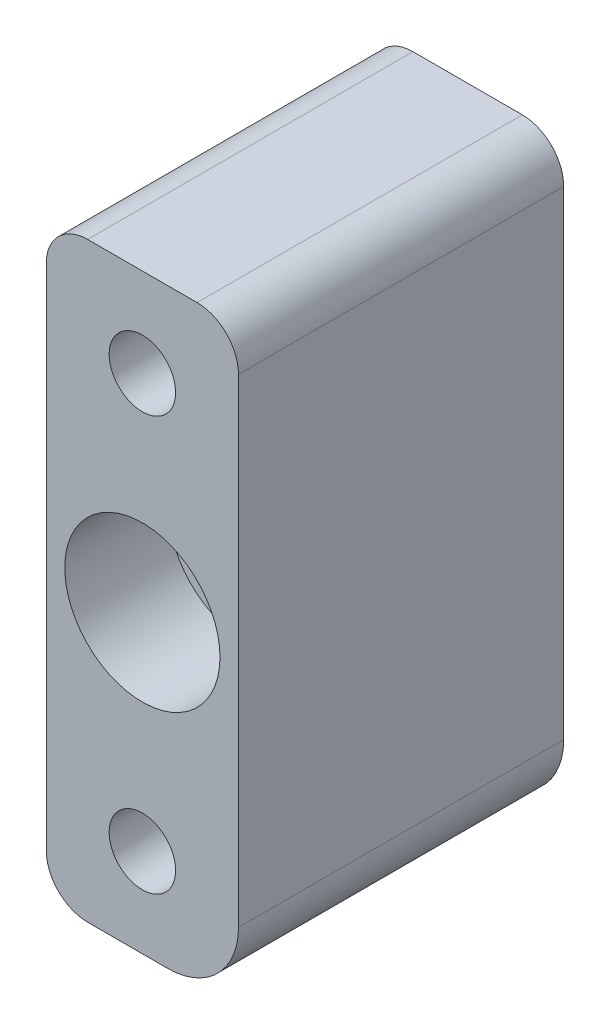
from build123d import *

# Parameters (mm, degrees)
BOSS_EXTRUDE1_DEPTH = 31.75
HOLE1_D             = 12.7
HOLE1_CBORE_D       = 16.66875
HOLE1_CBORE_DEPTH   = 11.1252
HOLE11_D            = 7.1374
HOLE11_CBORE_D      = 10.7188
HOLE11_CBORE_DEPTH  = 9.652
MOVE_FACE1_BY       = 3.175


with BuildPart() as part:
    # Sketch1 → Boss-Extrude1 (new body)
    with BuildSketch(Plane(origin=(0, 0, 40.2082), x_dir=(-1, 0, 0), z_dir=(0, 0, -1))):
        with BuildLine():
            Line((914.209045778, 0.799593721), (925.956545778, 0.799593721))
            ThreePointArc((925.956545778, 0.799593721), (929.099635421, -0.502316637), (930.401545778, -3.645406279))
            Line((930.401545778, -3.645406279), (930.401545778, -58.255406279))
            ThreePointArc((930.401545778, -58.255406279), (929.099635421, -61.398495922), (925.956545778, -62.700406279))
            Line((925.956545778, -62.700406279), (917.384045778, -62.700406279))
            ThreePointArc((917.384045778, -62.700406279), (911.995892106, -60.468559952), (909.764045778, -55.080406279))
            Line((909.764045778, -55.080406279), (909.764045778, -3.645406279))
            ThreePointArc((909.764045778, -3.645406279), (911.065956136, -0.502316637), (914.209045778, 0.799593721))
        make_face()
    extrude(amount=-BOSS_EXTRUDE1_DEPTH)

    # Hole1 (through all)
    with Locations(Plane(origin=(-932.951902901, -30.015406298, 71.9582), x_dir=(1, 0, 0), z_dir=(0, 0, 1))):
        with Locations((12.869107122, -0.934999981)):
            CounterBoreHole(HOLE1_D / 2, HOLE1_CBORE_D / 2, HOLE1_CBORE_DEPTH)

    # Hole11 (through all)
    with Locations(Plane(origin=(-907.213688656, -7.790406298, 40.2082), x_dir=(-1, 0, 0), z_dir=(0, 0, -1))):
        with Locations((12.869107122, -0.934999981), (12.869107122, -45.384999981)):
            CounterBoreHole(HOLE11_D / 2, HOLE11_CBORE_D / 2, HOLE11_CBORE_DEPTH)

    # Move Face1: a face moved outward by 3.175
    extrude(part.faces().sort_by_distance((-920.082795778, -46.825406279, 40.2082))[0], amount=MOVE_FACE1_BY, dir=(0, 0, -1))


solid = part.part
